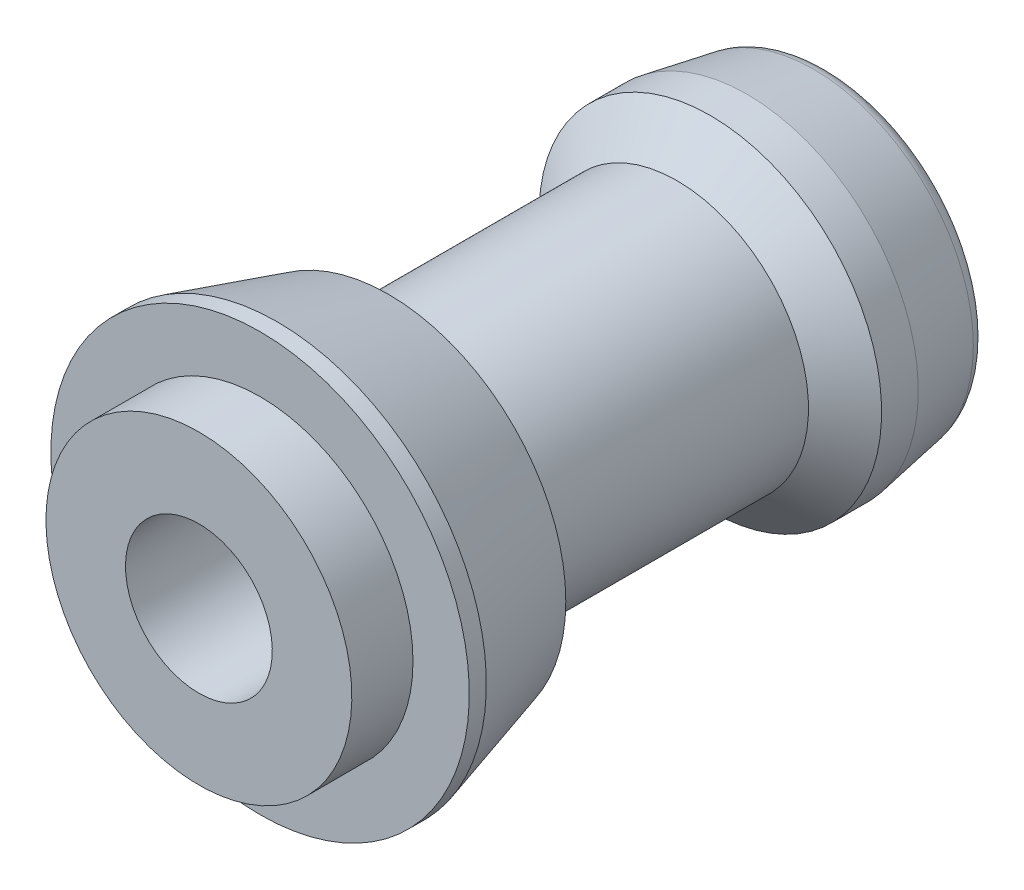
ISO-10303-21;
HEADER;
FILE_DESCRIPTION(('STEP AP214'),'2;1');
FILE_NAME('part.step','',(''),(''),'','','');
FILE_SCHEMA(('AUTOMOTIVE_DESIGN { 1 0 10303 214 1 1 1 1 }'));
ENDSEC;
DATA;
#1=APPLICATION_CONTEXT('core data for automotive mechanical design processes');
#2=APPLICATION_PROTOCOL_DEFINITION('international standard','automotive_design',2000,#1);
#3=PRODUCT_CONTEXT('',#1,'mechanical');
#4=PRODUCT('Part','Part','',(#3));
#5=PRODUCT_RELATED_PRODUCT_CATEGORY('part','',(#4));
#6=PRODUCT_DEFINITION_FORMATION('','',#4);
#7=PRODUCT_DEFINITION_CONTEXT('part definition',#1,'design');
#8=PRODUCT_DEFINITION('design','',#6,#7);
#9=PRODUCT_DEFINITION_SHAPE('','',#8);
#10=(LENGTH_UNIT() NAMED_UNIT(*) SI_UNIT(.MILLI.,.METRE.));
#11=(NAMED_UNIT(*) PLANE_ANGLE_UNIT() SI_UNIT($,.RADIAN.));
#12=(NAMED_UNIT(*) SI_UNIT($,.STERADIAN.) SOLID_ANGLE_UNIT());
#13=UNCERTAINTY_MEASURE_WITH_UNIT(LENGTH_MEASURE(1.E-05),#10,'distance_accuracy_value','');
#14=(GEOMETRIC_REPRESENTATION_CONTEXT(3) GLOBAL_UNCERTAINTY_ASSIGNED_CONTEXT((#13)) GLOBAL_UNIT_ASSIGNED_CONTEXT((#10,
#11,#12)) REPRESENTATION_CONTEXT('',''));
#15=CARTESIAN_POINT('',(0.,0.,0.));
#16=DIRECTION('',(0.,0.,1.));
#17=DIRECTION('',(1.,0.,0.));
#18=AXIS2_PLACEMENT_3D('',#15,#16,#17);
#19=CARTESIAN_POINT('',(0.,0.,5.));
#20=DIRECTION('',(0.,0.,1.));
#21=DIRECTION('',(0.,-1.,0.));
#22=AXIS2_PLACEMENT_3D('',#19,#20,#21);
#23=CYLINDRICAL_SURFACE('',#22,5.);
#24=CARTESIAN_POINT('',(0.,0.,-19.));
#25=DIRECTION('',(0.,0.,1.));
#26=DIRECTION('',(0.,-1.,0.));
#27=AXIS2_PLACEMENT_3D('',#24,#25,#26);
#28=CIRCLE('',#27,5.);
#29=CARTESIAN_POINT('',(0.,-4.99999999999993,-19.));
#30=VERTEX_POINT('',#29);
#31=EDGE_CURVE('E151',#30,#30,#28,.T.);
#32=ORIENTED_EDGE('',*,*,#31,.T.);
#33=EDGE_LOOP('',(#32));
#34=FACE_BOUND('',#33,.T.);
#35=CARTESIAN_POINT('',(0.,1.15218884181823E-13,-33.));
#36=DIRECTION('',(0.,0.,-1.));
#37=DIRECTION('',(0.,1.,0.));
#38=AXIS2_PLACEMENT_3D('',#35,#36,#37);
#39=CIRCLE('',#38,5.);
#40=CARTESIAN_POINT('',(0.,5.00000000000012,-33.));
#41=VERTEX_POINT('',#40);
#42=CARTESIAN_POINT('',(-4.3301270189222,2.50000000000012,-33.));
#43=VERTEX_POINT('',#42);
#44=EDGE_CURVE('E10',#41,#43,#39,.F.);
#45=ORIENTED_EDGE('',*,*,#44,.F.);
#46=CARTESIAN_POINT('',(4.3301270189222,2.50000000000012,-33.));
#47=VERTEX_POINT('',#46);
#48=EDGE_CURVE('E20',#47,#41,#39,.F.);
#49=ORIENTED_EDGE('',*,*,#48,.F.);
#50=CARTESIAN_POINT('',(4.33012701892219,-2.49999999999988,-33.));
#51=VERTEX_POINT('',#50);
#52=EDGE_CURVE('E91',#51,#47,#39,.F.);
#53=ORIENTED_EDGE('',*,*,#52,.F.);
#54=CARTESIAN_POINT('',(0.,-4.99999999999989,-33.));
#55=VERTEX_POINT('',#54);
#56=EDGE_CURVE('E202',#55,#51,#39,.F.);
#57=ORIENTED_EDGE('',*,*,#56,.F.);
#58=CARTESIAN_POINT('',(-4.3301270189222,-2.49999999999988,-33.));
#59=VERTEX_POINT('',#58);
#60=EDGE_CURVE('E203',#59,#55,#39,.F.);
#61=ORIENTED_EDGE('',*,*,#60,.F.);
#62=EDGE_CURVE('E25',#43,#59,#39,.F.);
#63=ORIENTED_EDGE('',*,*,#62,.F.);
#64=EDGE_LOOP('',(#45,#49,#53,#57,#61,#63));
#65=FACE_BOUND('',#64,.T.);
#66=ADVANCED_FACE('F16',(#34,#65),#23,.F.);
#67=CARTESIAN_POINT('',(0.,0.,0.));
#68=DIRECTION('',(0.,0.,1.));
#69=DIRECTION('',(0.,-1.,0.));
#70=AXIS2_PLACEMENT_3D('',#67,#68,#69);
#71=PLANE('',#70);
#72=CARTESIAN_POINT('',(0.,0.,0.));
#73=DIRECTION('',(0.,0.,1.));
#74=DIRECTION('',(0.,-1.,0.));
#75=AXIS2_PLACEMENT_3D('',#72,#73,#74);
#76=CIRCLE('',#75,12.5);
#77=CARTESIAN_POINT('',(0.,-12.5,0.));
#78=VERTEX_POINT('',#77);
#79=EDGE_CURVE('E178',#78,#78,#76,.T.);
#80=ORIENTED_EDGE('',*,*,#79,.F.);
#81=EDGE_LOOP('',(#80));
#82=FACE_BOUND('',#81,.T.);
#83=CARTESIAN_POINT('',(0.,0.,0.));
#84=DIRECTION('',(0.,0.,-1.));
#85=DIRECTION('',(0.,1.,0.));
#86=AXIS2_PLACEMENT_3D('',#83,#84,#85);
#87=CIRCLE('',#86,17.1);
#88=CARTESIAN_POINT('',(0.,17.1,0.));
#89=VERTEX_POINT('',#88);
#90=EDGE_CURVE('E175',#89,#89,#87,.T.);
#91=ORIENTED_EDGE('',*,*,#90,.F.);
#92=EDGE_LOOP('',(#91));
#93=FACE_BOUND('',#92,.T.);
#94=ADVANCED_FACE('F245',(#82,#93),#71,.T.);
#95=CARTESIAN_POINT('',(0.,0.,0.));
#96=DIRECTION('',(0.,0.,-1.));
#97=DIRECTION('',(0.,1.,0.));
#98=AXIS2_PLACEMENT_3D('',#95,#96,#97);
#99=CYLINDRICAL_SURFACE('',#98,17.1);
#100=ORIENTED_EDGE('',*,*,#90,.T.);
#101=EDGE_LOOP('',(#100));
#102=FACE_BOUND('',#101,.T.);
#103=CARTESIAN_POINT('',(0.,0.,-1.39496577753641));
#104=DIRECTION('',(0.,0.,-1.));
#105=DIRECTION('',(0.,1.,0.));
#106=AXIS2_PLACEMENT_3D('',#103,#104,#105);
#107=CIRCLE('',#106,17.1);
#108=CARTESIAN_POINT('',(0.,17.1,-1.39496577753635));
#109=VERTEX_POINT('',#108);
#110=EDGE_CURVE('E172',#109,#109,#107,.T.);
#111=ORIENTED_EDGE('',*,*,#110,.F.);
#112=EDGE_LOOP('',(#111));
#113=FACE_BOUND('',#112,.T.);
#114=ADVANCED_FACE('F252',(#102,#113),#99,.T.);
#115=CARTESIAN_POINT('',(0.,0.,-10.5));
#116=DIRECTION('',(0.,0.,1.));
#117=DIRECTION('',(0.,-1.,0.));
#118=AXIS2_PLACEMENT_3D('',#115,#116,#117);
#119=CONICAL_SURFACE('',#118,14.4891734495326,0.279252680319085);
#120=ORIENTED_EDGE('',*,*,#110,.T.);
#121=EDGE_LOOP('',(#120));
#122=FACE_BOUND('',#121,.T.);
#123=CARTESIAN_POINT('',(0.,0.,-10.5));
#124=DIRECTION('',(0.,0.,-1.));
#125=DIRECTION('',(0.,1.,0.));
#126=AXIS2_PLACEMENT_3D('',#123,#124,#125);
#127=CIRCLE('',#126,14.4891734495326);
#128=CARTESIAN_POINT('',(0.,14.4891734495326,-10.5));
#129=VERTEX_POINT('',#128);
#130=EDGE_CURVE('E169',#129,#129,#127,.T.);
#131=ORIENTED_EDGE('',*,*,#130,.F.);
#132=EDGE_LOOP('',(#131));
#133=FACE_BOUND('',#132,.T.);
#134=ADVANCED_FACE('F289',(#122,#133),#119,.T.);
#135=CARTESIAN_POINT('',(0.,0.,-12.6588127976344));
#136=DIRECTION('',(0.,0.,1.));
#137=DIRECTION('',(0.,-1.,0.));
#138=AXIS2_PLACEMENT_3D('',#135,#136,#137);
#139=CONICAL_SURFACE('',#138,10.75,1.0471975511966);
#140=ORIENTED_EDGE('',*,*,#130,.T.);
#141=EDGE_LOOP('',(#140));
#142=FACE_BOUND('',#141,.T.);
#143=CARTESIAN_POINT('',(0.,0.,-12.6588127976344));
#144=DIRECTION('',(0.,0.,1.));
#145=DIRECTION('',(0.,-1.,0.));
#146=AXIS2_PLACEMENT_3D('',#143,#144,#145);
#147=CIRCLE('',#146,10.75);
#148=CARTESIAN_POINT('',(0.,-10.75,-12.6588127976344));
#149=VERTEX_POINT('',#148);
#150=EDGE_CURVE('E166',#149,#149,#147,.T.);
#151=ORIENTED_EDGE('',*,*,#150,.T.);
#152=EDGE_LOOP('',(#151));
#153=FACE_BOUND('',#152,.T.);
#154=ADVANCED_FACE('F285',(#142,#153),#139,.T.);
#155=CARTESIAN_POINT('',(0.,0.,0.));
#156=DIRECTION('',(0.,0.,1.));
#157=DIRECTION('',(0.,-1.,0.));
#158=AXIS2_PLACEMENT_3D('',#155,#156,#157);
#159=CYLINDRICAL_SURFACE('',#158,10.75);
#160=ORIENTED_EDGE('',*,*,#150,.F.);
#161=EDGE_LOOP('',(#160));
#162=FACE_BOUND('',#161,.T.);
#163=CARTESIAN_POINT('',(0.,1.18964985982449E-13,-34.0729261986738));
#164=DIRECTION('',(0.,0.,1.));
#165=DIRECTION('',(0.,-1.,0.));
#166=AXIS2_PLACEMENT_3D('',#163,#164,#165);
#167=CIRCLE('',#166,10.75);
#168=CARTESIAN_POINT('',(0.,-10.7499999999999,-34.0729261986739));
#169=VERTEX_POINT('',#168);
#170=EDGE_CURVE('E163',#169,#169,#167,.T.);
#171=ORIENTED_EDGE('',*,*,#170,.T.);
#172=EDGE_LOOP('',(#171));
#173=FACE_BOUND('',#172,.T.);
#174=ADVANCED_FACE('F281',(#162,#173),#159,.T.);
#175=CARTESIAN_POINT('',(0.,1.28486513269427E-13,-36.8));
#176=DIRECTION('',(0.,0.,-1.));
#177=DIRECTION('',(0.,1.,0.));
#178=AXIS2_PLACEMENT_3D('',#175,#176,#177);
#179=CONICAL_SURFACE('',#178,14.,0.872664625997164);
#180=ORIENTED_EDGE('',*,*,#170,.F.);
#181=EDGE_LOOP('',(#180));
#182=FACE_BOUND('',#181,.T.);
#183=CARTESIAN_POINT('',(0.,1.28486513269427E-13,-36.8));
#184=DIRECTION('',(0.,0.,1.));
#185=DIRECTION('',(0.,-1.,0.));
#186=AXIS2_PLACEMENT_3D('',#183,#184,#185);
#187=CIRCLE('',#186,14.);
#188=CARTESIAN_POINT('',(0.,-13.9999999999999,-36.8));
#189=VERTEX_POINT('',#188);
#190=EDGE_CURVE('E160',#189,#189,#187,.T.);
#191=ORIENTED_EDGE('',*,*,#190,.T.);
#192=EDGE_LOOP('',(#191));
#193=FACE_BOUND('',#192,.T.);
#194=ADVANCED_FACE('F277',(#182,#193),#179,.T.);
#195=CARTESIAN_POINT('',(0.,0.,0.));
#196=DIRECTION('',(0.,0.,1.));
#197=DIRECTION('',(0.,-1.,0.));
#198=AXIS2_PLACEMENT_3D('',#195,#196,#197);
#199=CYLINDRICAL_SURFACE('',#198,14.);
#200=ORIENTED_EDGE('',*,*,#190,.F.);
#201=EDGE_LOOP('',(#200));
#202=FACE_BOUND('',#201,.T.);
#203=CARTESIAN_POINT('',(0.,1.38960957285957E-13,-39.8));
#204=DIRECTION('',(0.,0.,1.));
#205=DIRECTION('',(0.,-1.,0.));
#206=AXIS2_PLACEMENT_3D('',#203,#204,#205);
#207=CIRCLE('',#206,14.);
#208=CARTESIAN_POINT('',(0.,-13.9999999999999,-39.8000000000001));
#209=VERTEX_POINT('',#208);
#210=EDGE_CURVE('E157',#209,#209,#207,.T.);
#211=ORIENTED_EDGE('',*,*,#210,.T.);
#212=EDGE_LOOP('',(#211));
#213=FACE_BOUND('',#212,.T.);
#214=ADVANCED_FACE('F273',(#202,#213),#199,.T.);
#215=CARTESIAN_POINT('',(0.,1.62353882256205E-13,-46.5));
#216=DIRECTION('',(0.,0.,1.));
#217=DIRECTION('',(0.,-1.,0.));
#218=AXIS2_PLACEMENT_3D('',#215,#216,#217);
#219=CONICAL_SURFACE('',#218,12.8186092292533,0.174532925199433);
#220=CARTESIAN_POINT('',(0.,1.58026094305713E-13,-45.2604722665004));
#221=DIRECTION('',(0.,0.,-1.));
#222=DIRECTION('',(0.,1.,0.));
#223=AXIS2_PLACEMENT_3D('',#220,#221,#222);
#224=CIRCLE('',#223,13.0371714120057);
#225=CARTESIAN_POINT('',(0.,13.0371714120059,-45.2604722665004));
#226=VERTEX_POINT('',#225);
#227=EDGE_CURVE('E181',#226,#226,#224,.F.);
#228=ORIENTED_EDGE('',*,*,#227,.T.);
#229=EDGE_LOOP('',(#228));
#230=FACE_BOUND('',#229,.T.);
#231=ORIENTED_EDGE('',*,*,#210,.F.);
#232=EDGE_LOOP('',(#231));
#233=FACE_BOUND('',#232,.T.);
#234=ADVANCED_FACE('F269',(#230,#233),#219,.T.);
#235=CARTESIAN_POINT('',(12.8186092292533,1.62353882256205E-13,-46.5));
#236=DIRECTION('',(0.,0.,1.));
#237=DIRECTION('',(0.,-1.,0.));
#238=AXIS2_PLACEMENT_3D('',#235,#236,#237);
#239=PLANE('',#238);
#240=CARTESIAN_POINT('',(0.,1.62353882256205E-13,-46.5));
#241=DIRECTION('',(0.,0.,1.));
#242=DIRECTION('',(0.,-1.,0.));
#243=AXIS2_PLACEMENT_3D('',#240,#241,#242);
#244=CIRCLE('',#243,8.25);
#245=CARTESIAN_POINT('',(0.,-8.24999999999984,-46.5));
#246=VERTEX_POINT('',#245);
#247=EDGE_CURVE('E128',#246,#246,#244,.T.);
#248=ORIENTED_EDGE('',*,*,#247,.T.);
#249=EDGE_LOOP('',(#248));
#250=FACE_BOUND('',#249,.T.);
#251=CARTESIAN_POINT('',(0.,1.62353882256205E-13,-46.5));
#252=DIRECTION('',(0.,0.,1.));
#253=DIRECTION('',(0.,-1.,0.));
#254=AXIS2_PLACEMENT_3D('',#251,#252,#253);
#255=CIRCLE('',#254,11.5599597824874);
#256=CARTESIAN_POINT('',(0.,-11.5599597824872,-46.5));
#257=VERTEX_POINT('',#256);
#258=EDGE_CURVE('E184',#257,#257,#255,.F.);
#259=ORIENTED_EDGE('',*,*,#258,.T.);
#260=EDGE_LOOP('',(#259));
#261=FACE_BOUND('',#260,.T.);
#262=ADVANCED_FACE('F265',(#250,#261),#239,.F.);
#263=CARTESIAN_POINT('',(0.,0.,5.));
#264=DIRECTION('',(0.,0.,1.));
#265=DIRECTION('',(0.,-1.,0.));
#266=AXIS2_PLACEMENT_3D('',#263,#264,#265);
#267=PLANE('',#266);
#268=CARTESIAN_POINT('',(0.,0.,5.));
#269=DIRECTION('',(0.,0.,1.));
#270=DIRECTION('',(0.,-1.,0.));
#271=AXIS2_PLACEMENT_3D('',#268,#269,#270);
#272=CIRCLE('',#271,6.);
#273=CARTESIAN_POINT('',(0.,-6.00000000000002,4.99999999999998));
#274=VERTEX_POINT('',#273);
#275=EDGE_CURVE('E145',#274,#274,#272,.T.);
#276=ORIENTED_EDGE('',*,*,#275,.F.);
#277=EDGE_LOOP('',(#276));
#278=FACE_BOUND('',#277,.T.);
#279=CARTESIAN_POINT('',(0.,0.,5.));
#280=DIRECTION('',(0.,0.,-1.));
#281=DIRECTION('',(0.,1.,0.));
#282=AXIS2_PLACEMENT_3D('',#279,#280,#281);
#283=CIRCLE('',#282,12.5);
#284=CARTESIAN_POINT('',(0.,12.5,5.00000000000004));
#285=VERTEX_POINT('',#284);
#286=EDGE_CURVE('E154',#285,#285,#283,.T.);
#287=ORIENTED_EDGE('',*,*,#286,.F.);
#288=EDGE_LOOP('',(#287));
#289=FACE_BOUND('',#288,.T.);
#290=ADVANCED_FACE('F261',(#278,#289),#267,.T.);
#291=CARTESIAN_POINT('',(0.,0.,0.));
#292=DIRECTION('',(0.,0.,-1.));
#293=DIRECTION('',(0.,1.,0.));
#294=AXIS2_PLACEMENT_3D('',#291,#292,#293);
#295=CYLINDRICAL_SURFACE('',#294,12.5);
#296=ORIENTED_EDGE('',*,*,#286,.T.);
#297=EDGE_LOOP('',(#296));
#298=FACE_BOUND('',#297,.T.);
#299=ORIENTED_EDGE('',*,*,#79,.T.);
#300=EDGE_LOOP('',(#299));
#301=FACE_BOUND('',#300,.T.);
#302=ADVANCED_FACE('F258',(#298,#301),#295,.T.);
#303=CARTESIAN_POINT('',(0.,1.57116660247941E-13,-45.));
#304=DIRECTION('',(0.,0.,1.));
#305=DIRECTION('',(0.,-1.,0.));
#306=AXIS2_PLACEMENT_3D('',#303,#304,#305);
#307=TOROIDAL_SURFACE('',#306,11.5599597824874,1.5);
#308=ORIENTED_EDGE('',*,*,#258,.F.);
#309=EDGE_LOOP('',(#308));
#310=FACE_BOUND('',#309,.T.);
#311=ORIENTED_EDGE('',*,*,#227,.F.);
#312=EDGE_LOOP('',(#311));
#313=FACE_BOUND('',#312,.T.);
#314=ADVANCED_FACE('F18',(#310,#313),#307,.T.);
#315=CARTESIAN_POINT('',(6.,0.,-19.));
#316=DIRECTION('',(0.,0.,-1.));
#317=DIRECTION('',(0.,1.,0.));
#318=AXIS2_PLACEMENT_3D('',#315,#316,#317);
#319=PLANE('',#318);
#320=ORIENTED_EDGE('',*,*,#31,.F.);
#321=EDGE_LOOP('',(#320));
#322=FACE_BOUND('',#321,.T.);
#323=CARTESIAN_POINT('',(0.,0.,-19.));
#324=DIRECTION('',(0.,0.,1.));
#325=DIRECTION('',(0.,-1.,0.));
#326=AXIS2_PLACEMENT_3D('',#323,#324,#325);
#327=CIRCLE('',#326,6.);
#328=CARTESIAN_POINT('',(0.,-5.99999999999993,-19.));
#329=VERTEX_POINT('',#328);
#330=EDGE_CURVE('E148',#329,#329,#327,.T.);
#331=ORIENTED_EDGE('',*,*,#330,.T.);
#332=EDGE_LOOP('',(#331));
#333=FACE_BOUND('',#332,.T.);
#334=ADVANCED_FACE('F256',(#322,#333),#319,.F.);
#335=CARTESIAN_POINT('',(0.,0.,5.));
#336=DIRECTION('',(0.,0.,1.));
#337=DIRECTION('',(0.,-1.,0.));
#338=AXIS2_PLACEMENT_3D('',#335,#336,#337);
#339=CYLINDRICAL_SURFACE('',#338,6.);
#340=ORIENTED_EDGE('',*,*,#330,.F.);
#341=EDGE_LOOP('',(#340));
#342=FACE_BOUND('',#341,.T.);
#343=ORIENTED_EDGE('',*,*,#275,.T.);
#344=EDGE_LOOP('',(#343));
#345=FACE_BOUND('',#344,.T.);
#346=ADVANCED_FACE('F379',(#342,#345),#339,.F.);
#347=CARTESIAN_POINT('',(8.25,1.39659253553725E-13,-40.));
#348=DIRECTION('',(0.,0.,-1.));
#349=DIRECTION('',(0.,1.,0.));
#350=AXIS2_PLACEMENT_3D('',#347,#348,#349);
#351=PLANE('',#350);
#352=DIRECTION('',(0.5,0.866025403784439,0.));
#353=VECTOR('',#352,1.);
#354=CARTESIAN_POINT('',(-2.26762701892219,6.07235479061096,-40.));
#355=LINE('',#354,#353);
#356=CARTESIAN_POINT('',(-5.77350269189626,1.40506067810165E-13,-40.));
#357=VERTEX_POINT('',#356);
#358=CARTESIAN_POINT('',(-2.88675134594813,5.00000000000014,-40.));
#359=VERTEX_POINT('',#358);
#360=EDGE_CURVE('E197',#357,#359,#355,.T.);
#361=ORIENTED_EDGE('',*,*,#360,.F.);
#362=DIRECTION('',(-0.5,0.866025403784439,0.));
#363=VECTOR('',#362,1.);
#364=CARTESIAN_POINT('',(-2.26762701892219,-6.07235479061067,-40.));
#365=LINE('',#364,#363);
#366=CARTESIAN_POINT('',(-2.88675134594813,-4.99999999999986,-40.));
#367=VERTEX_POINT('',#366);
#368=EDGE_CURVE('E194',#367,#357,#365,.T.);
#369=ORIENTED_EDGE('',*,*,#368,.F.);
#370=DIRECTION('',(-1.,0.,0.));
#371=VECTOR('',#370,1.);
#372=CARTESIAN_POINT('',(8.25,-4.99999999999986,-40.));
#373=LINE('',#372,#371);
#374=CARTESIAN_POINT('',(2.88675134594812,-4.99999999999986,-40.));
#375=VERTEX_POINT('',#374);
#376=EDGE_CURVE('E189',#375,#367,#373,.T.);
#377=ORIENTED_EDGE('',*,*,#376,.F.);
#378=DIRECTION('',(-0.5,-0.866025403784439,0.));
#379=VECTOR('',#378,1.);
#380=CARTESIAN_POINT('',(6.3926270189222,1.07235479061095,-40.));
#381=LINE('',#380,#379);
#382=CARTESIAN_POINT('',(5.77350269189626,1.41387619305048E-13,-40.));
#383=VERTEX_POINT('',#382);
#384=EDGE_CURVE('E187',#383,#375,#381,.T.);
#385=ORIENTED_EDGE('',*,*,#384,.F.);
#386=DIRECTION('',(0.5,-0.866025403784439,0.));
#387=VECTOR('',#386,1.);
#388=CARTESIAN_POINT('',(6.3926270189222,-1.07235479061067,-40.));
#389=LINE('',#388,#387);
#390=CARTESIAN_POINT('',(2.88675134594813,5.00000000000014,-40.));
#391=VERTEX_POINT('',#390);
#392=EDGE_CURVE('E99',#391,#383,#389,.T.);
#393=ORIENTED_EDGE('',*,*,#392,.F.);
#394=DIRECTION('',(1.,0.,0.));
#395=VECTOR('',#394,1.);
#396=CARTESIAN_POINT('',(8.25,5.00000000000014,-40.));
#397=LINE('',#396,#395);
#398=EDGE_CURVE('E192',#359,#391,#397,.T.);
#399=ORIENTED_EDGE('',*,*,#398,.F.);
#400=EDGE_LOOP('',(#361,#369,#377,#385,#393,#399));
#401=FACE_BOUND('',#400,.T.);
#402=CARTESIAN_POINT('',(0.,1.39659253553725E-13,-40.));
#403=DIRECTION('',(0.,0.,1.));
#404=DIRECTION('',(0.,-1.,0.));
#405=AXIS2_PLACEMENT_3D('',#402,#403,#404);
#406=CIRCLE('',#405,8.25);
#407=CARTESIAN_POINT('',(0.,-8.24999999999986,-40.));
#408=VERTEX_POINT('',#407);
#409=EDGE_CURVE('E142',#408,#408,#406,.T.);
#410=ORIENTED_EDGE('',*,*,#409,.F.);
#411=EDGE_LOOP('',(#410));
#412=FACE_BOUND('',#411,.T.);
#413=ADVANCED_FACE('F387',(#401,#412),#351,.T.);
#414=CARTESIAN_POINT('',(0.,0.,0.));
#415=DIRECTION('',(0.,0.,1.));
#416=DIRECTION('',(0.,-1.,0.));
#417=AXIS2_PLACEMENT_3D('',#414,#415,#416);
#418=CYLINDRICAL_SURFACE('',#417,8.25);
#419=ORIENTED_EDGE('',*,*,#409,.T.);
#420=EDGE_LOOP('',(#419));
#421=FACE_BOUND('',#420,.T.);
#422=ORIENTED_EDGE('',*,*,#247,.F.);
#423=EDGE_LOOP('',(#422));
#424=FACE_BOUND('',#423,.T.);
#425=ADVANCED_FACE('F243',(#421,#424),#418,.F.);
#426=CARTESIAN_POINT('',(0.,1.15218884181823E-13,-33.));
#427=DIRECTION('',(0.,0.,-1.));
#428=DIRECTION('',(0.,1.,0.));
#429=AXIS2_PLACEMENT_3D('',#426,#427,#428);
#430=PLANE('',#429);
#431=ORIENTED_EDGE('',*,*,#44,.T.);
#432=DIRECTION('',(0.5,0.866025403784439,0.));
#433=VECTOR('',#432,1.);
#434=CARTESIAN_POINT('',(-5.77350269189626,1.16065698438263E-13,-33.));
#435=LINE('',#434,#433);
#436=CARTESIAN_POINT('',(-2.88675134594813,5.00000000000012,-33.));
#437=VERTEX_POINT('',#436);
#438=EDGE_CURVE('E119',#43,#437,#435,.T.);
#439=ORIENTED_EDGE('',*,*,#438,.T.);
#440=DIRECTION('',(1.,0.,0.));
#441=VECTOR('',#440,1.);
#442=CARTESIAN_POINT('',(-2.88675134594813,5.00000000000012,-33.));
#443=LINE('',#442,#441);
#444=EDGE_CURVE('E103',#437,#41,#443,.T.);
#445=ORIENTED_EDGE('',*,*,#444,.T.);
#446=EDGE_LOOP('',(#431,#439,#445));
#447=FACE_BOUND('',#446,.T.);
#448=ADVANCED_FACE('F224',(#447),#430,.T.);
#449=ORIENTED_EDGE('',*,*,#62,.T.);
#450=DIRECTION('',(-0.5,0.866025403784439,0.));
#451=VECTOR('',#450,1.);
#452=CARTESIAN_POINT('',(-2.88675134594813,-4.99999999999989,-33.));
#453=LINE('',#452,#451);
#454=CARTESIAN_POINT('',(-5.77350269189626,1.16065698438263E-13,-33.));
#455=VERTEX_POINT('',#454);
#456=EDGE_CURVE('E115',#59,#455,#453,.T.);
#457=ORIENTED_EDGE('',*,*,#456,.T.);
#458=EDGE_CURVE('E120',#455,#43,#435,.T.);
#459=ORIENTED_EDGE('',*,*,#458,.T.);
#460=EDGE_LOOP('',(#449,#457,#459));
#461=FACE_BOUND('',#460,.T.);
#462=ADVANCED_FACE('F212',(#461),#430,.T.);
#463=ORIENTED_EDGE('',*,*,#60,.T.);
#464=DIRECTION('',(-1.,0.,0.));
#465=VECTOR('',#464,1.);
#466=CARTESIAN_POINT('',(2.88675134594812,-4.99999999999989,-33.));
#467=LINE('',#466,#465);
#468=CARTESIAN_POINT('',(-2.88675134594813,-4.99999999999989,-33.));
#469=VERTEX_POINT('',#468);
#470=EDGE_CURVE('E109',#55,#469,#467,.T.);
#471=ORIENTED_EDGE('',*,*,#470,.T.);
#472=EDGE_CURVE('E116',#469,#59,#453,.T.);
#473=ORIENTED_EDGE('',*,*,#472,.T.);
#474=EDGE_LOOP('',(#463,#471,#473));
#475=FACE_BOUND('',#474,.T.);
#476=ADVANCED_FACE('F220',(#475),#430,.T.);
#477=ORIENTED_EDGE('',*,*,#56,.T.);
#478=DIRECTION('',(-0.5,-0.866025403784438,0.));
#479=VECTOR('',#478,1.);
#480=CARTESIAN_POINT('',(5.77350269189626,1.16947249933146E-13,-33.));
#481=LINE('',#480,#479);
#482=CARTESIAN_POINT('',(2.88675134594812,-4.99999999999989,-33.));
#483=VERTEX_POINT('',#482);
#484=EDGE_CURVE('E108',#51,#483,#481,.T.);
#485=ORIENTED_EDGE('',*,*,#484,.T.);
#486=EDGE_CURVE('E111',#483,#55,#467,.T.);
#487=ORIENTED_EDGE('',*,*,#486,.T.);
#488=EDGE_LOOP('',(#477,#485,#487));
#489=FACE_BOUND('',#488,.T.);
#490=ADVANCED_FACE('F240',(#489),#430,.T.);
#491=ORIENTED_EDGE('',*,*,#52,.T.);
#492=DIRECTION('',(0.5,-0.866025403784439,0.));
#493=VECTOR('',#492,1.);
#494=CARTESIAN_POINT('',(2.88675134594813,5.00000000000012,-33.));
#495=LINE('',#494,#493);
#496=CARTESIAN_POINT('',(5.77350269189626,1.16947249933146E-13,-33.));
#497=VERTEX_POINT('',#496);
#498=EDGE_CURVE('E85',#47,#497,#495,.T.);
#499=ORIENTED_EDGE('',*,*,#498,.T.);
#500=EDGE_CURVE('E89',#497,#51,#481,.T.);
#501=ORIENTED_EDGE('',*,*,#500,.T.);
#502=EDGE_LOOP('',(#491,#499,#501));
#503=FACE_BOUND('',#502,.T.);
#504=ADVANCED_FACE('F87',(#503),#430,.T.);
#505=ORIENTED_EDGE('',*,*,#48,.T.);
#506=CARTESIAN_POINT('',(2.88675134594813,5.00000000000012,-33.));
#507=VERTEX_POINT('',#506);
#508=EDGE_CURVE('E123',#41,#507,#443,.T.);
#509=ORIENTED_EDGE('',*,*,#508,.T.);
#510=EDGE_CURVE('E32',#507,#47,#495,.T.);
#511=ORIENTED_EDGE('',*,*,#510,.T.);
#512=EDGE_LOOP('',(#505,#509,#511));
#513=FACE_BOUND('',#512,.T.);
#514=ADVANCED_FACE('F230',(#513),#430,.T.);
#515=CARTESIAN_POINT('',(2.88675134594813,5.00000000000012,-33.));
#516=DIRECTION('',(0.866025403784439,0.5,0.));
#517=DIRECTION('',(-0.5,0.866025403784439,0.));
#518=AXIS2_PLACEMENT_3D('',#515,#516,#517);
#519=PLANE('',#518);
#520=ORIENTED_EDGE('',*,*,#510,.F.);
#521=DIRECTION('',(0.,0.,-1.));
#522=VECTOR('',#521,1.);
#523=CARTESIAN_POINT('',(2.88675134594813,5.00000000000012,-33.));
#524=LINE('',#523,#522);
#525=EDGE_CURVE('E126',#507,#391,#524,.T.);
#526=ORIENTED_EDGE('',*,*,#525,.T.);
#527=ORIENTED_EDGE('',*,*,#392,.T.);
#528=DIRECTION('',(0.,0.,-1.));
#529=VECTOR('',#528,1.);
#530=CARTESIAN_POINT('',(5.77350269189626,1.16947249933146E-13,-33.));
#531=LINE('',#530,#529);
#532=EDGE_CURVE('E96',#497,#383,#531,.T.);
#533=ORIENTED_EDGE('',*,*,#532,.F.);
#534=ORIENTED_EDGE('',*,*,#498,.F.);
#535=EDGE_LOOP('',(#520,#526,#527,#533,#534));
#536=FACE_BOUND('',#535,.T.);
#537=ADVANCED_FACE('F97',(#536),#519,.F.);
#538=CARTESIAN_POINT('',(-2.88675134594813,5.00000000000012,-33.));
#539=DIRECTION('',(0.,1.,0.));
#540=DIRECTION('',(-1.,0.,0.));
#541=AXIS2_PLACEMENT_3D('',#538,#539,#540);
#542=PLANE('',#541);
#543=ORIENTED_EDGE('',*,*,#444,.F.);
#544=DIRECTION('',(0.,0.,-1.));
#545=VECTOR('',#544,1.);
#546=CARTESIAN_POINT('',(-2.88675134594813,5.00000000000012,-33.));
#547=LINE('',#546,#545);
#548=EDGE_CURVE('E129',#437,#359,#547,.T.);
#549=ORIENTED_EDGE('',*,*,#548,.T.);
#550=ORIENTED_EDGE('',*,*,#398,.T.);
#551=ORIENTED_EDGE('',*,*,#525,.F.);
#552=ORIENTED_EDGE('',*,*,#508,.F.);
#553=EDGE_LOOP('',(#543,#549,#550,#551,#552));
#554=FACE_BOUND('',#553,.T.);
#555=ADVANCED_FACE('F228',(#554),#542,.F.);
#556=CARTESIAN_POINT('',(-5.77350269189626,1.16065698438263E-13,-33.));
#557=DIRECTION('',(-0.866025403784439,0.5,0.));
#558=DIRECTION('',(-0.5,-0.866025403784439,0.));
#559=AXIS2_PLACEMENT_3D('',#556,#557,#558);
#560=PLANE('',#559);
#561=ORIENTED_EDGE('',*,*,#458,.F.);
#562=DIRECTION('',(0.,0.,-1.));
#563=VECTOR('',#562,1.);
#564=CARTESIAN_POINT('',(-5.77350269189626,1.16065698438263E-13,-33.));
#565=LINE('',#564,#563);
#566=EDGE_CURVE('E132',#455,#357,#565,.T.);
#567=ORIENTED_EDGE('',*,*,#566,.T.);
#568=ORIENTED_EDGE('',*,*,#360,.T.);
#569=ORIENTED_EDGE('',*,*,#548,.F.);
#570=ORIENTED_EDGE('',*,*,#438,.F.);
#571=EDGE_LOOP('',(#561,#567,#568,#569,#570));
#572=FACE_BOUND('',#571,.T.);
#573=ADVANCED_FACE('F226',(#572),#560,.F.);
#574=CARTESIAN_POINT('',(-2.88675134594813,-4.99999999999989,-33.));
#575=DIRECTION('',(-0.866025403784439,-0.5,0.));
#576=DIRECTION('',(0.5,-0.866025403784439,0.));
#577=AXIS2_PLACEMENT_3D('',#574,#575,#576);
#578=PLANE('',#577);
#579=ORIENTED_EDGE('',*,*,#472,.F.);
#580=DIRECTION('',(0.,0.,-1.));
#581=VECTOR('',#580,1.);
#582=CARTESIAN_POINT('',(-2.88675134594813,-4.99999999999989,-33.));
#583=LINE('',#582,#581);
#584=EDGE_CURVE('E135',#469,#367,#583,.T.);
#585=ORIENTED_EDGE('',*,*,#584,.T.);
#586=ORIENTED_EDGE('',*,*,#368,.T.);
#587=ORIENTED_EDGE('',*,*,#566,.F.);
#588=ORIENTED_EDGE('',*,*,#456,.F.);
#589=EDGE_LOOP('',(#579,#585,#586,#587,#588));
#590=FACE_BOUND('',#589,.T.);
#591=ADVANCED_FACE('F219',(#590),#578,.F.);
#592=CARTESIAN_POINT('',(2.88675134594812,-4.99999999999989,-33.));
#593=DIRECTION('',(0.,-1.,0.));
#594=DIRECTION('',(1.,0.,0.));
#595=AXIS2_PLACEMENT_3D('',#592,#593,#594);
#596=PLANE('',#595);
#597=ORIENTED_EDGE('',*,*,#486,.F.);
#598=DIRECTION('',(0.,0.,-1.));
#599=VECTOR('',#598,1.);
#600=CARTESIAN_POINT('',(2.88675134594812,-4.99999999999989,-33.));
#601=LINE('',#600,#599);
#602=EDGE_CURVE('E102',#483,#375,#601,.T.);
#603=ORIENTED_EDGE('',*,*,#602,.T.);
#604=ORIENTED_EDGE('',*,*,#376,.T.);
#605=ORIENTED_EDGE('',*,*,#584,.F.);
#606=ORIENTED_EDGE('',*,*,#470,.F.);
#607=EDGE_LOOP('',(#597,#603,#604,#605,#606));
#608=FACE_BOUND('',#607,.T.);
#609=ADVANCED_FACE('F466',(#608),#596,.F.);
#610=CARTESIAN_POINT('',(5.77350269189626,1.16947249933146E-13,-33.));
#611=DIRECTION('',(0.866025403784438,-0.5,0.));
#612=DIRECTION('',(0.5,0.866025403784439,0.));
#613=AXIS2_PLACEMENT_3D('',#610,#611,#612);
#614=PLANE('',#613);
#615=ORIENTED_EDGE('',*,*,#500,.F.);
#616=ORIENTED_EDGE('',*,*,#532,.T.);
#617=ORIENTED_EDGE('',*,*,#384,.T.);
#618=ORIENTED_EDGE('',*,*,#602,.F.);
#619=ORIENTED_EDGE('',*,*,#484,.F.);
#620=EDGE_LOOP('',(#615,#616,#617,#618,#619));
#621=FACE_BOUND('',#620,.T.);
#622=ADVANCED_FACE('F106',(#621),#614,.F.);
#623=CLOSED_SHELL('',(#66,#94,#114,#134,#154,#174,#194,#214,#234,#262,#290,#302,#314,#334,#346,
#413,#425,#448,#462,#476,#490,#504,#514,#537,#555,#573,#591,#609,#622));
#624=MANIFOLD_SOLID_BREP('B1',#623);
#625=ADVANCED_BREP_SHAPE_REPRESENTATION('',(#18,#624),#14);
#626=SHAPE_DEFINITION_REPRESENTATION(#9,#625);
ENDSEC;
END-ISO-10303-21;
